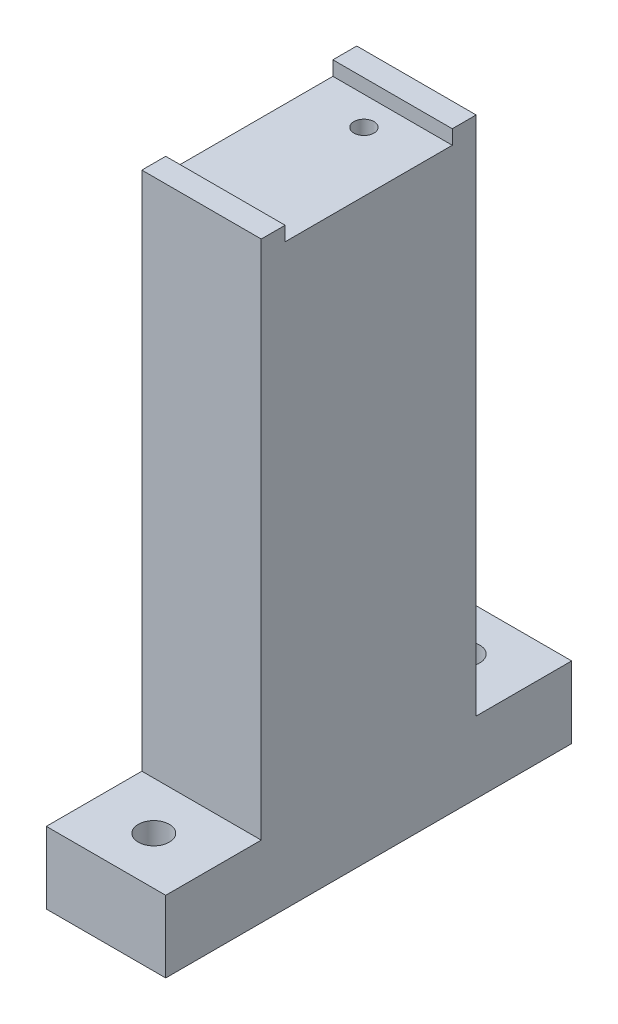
from build123d import *

# Parameters (mm, degrees)
SKETCH_1_W          = 25
SKETCH_1_H          = 124
EXTRUDE_1_DEPTH     = 85
SKETCH_2_OUTSIDE_W  = 117.48
SKETCH_2_OUTSIDE_H  = 156.48
CUT_EXTRUDE_1_DEPTH = 85
SKETCH_3_R          = 3.25
CUT_EXTRUDE_2_DEPTH = 150.969996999
SKETCH_4_R          = 2.1
CUT_EXTRUDE_3_DEPTH = 15


with BuildPart() as part:
    # Sketch 1 → Extrude 1 (new body)
    with BuildSketch(Plane.XY):
        with Locations((12.5, 62)):
            Rectangle(SKETCH_1_W, SKETCH_1_H)
    extrude(amount=EXTRUDE_1_DEPTH)

    # Sketch 2 outside → Cut-Extrude 1 (cut)
    with BuildSketch(Plane(origin=(25, 0, 0), x_dir=(0, 0, -1), z_dir=(1, 0, 0))):
        with Locations((-42.5, 62)):
            Rectangle(SKETCH_2_OUTSIDE_W, SKETCH_2_OUTSIDE_H)
        Polygon((-60, 121), (-25, 121), (-25, 124), (-20, 124), (-20, 15), (0, 15), (0, 0), (-85, 0), (-85, 15), (-65, 15), (-65, 124), (-60, 124), align=None, mode=Mode.SUBTRACT)
    extrude(amount=-CUT_EXTRUDE_1_DEPTH, mode=Mode.SUBTRACT)

    # Sketch 3 → Cut-Extrude 2 (cut, through all)
    with BuildSketch(Plane(origin=(0, 121, 0), x_dir=(1, 0, 0), z_dir=(0, 1, 0))):
        with Locations(Location((12.5, -10, 0), (0, 0, 270))):
            Circle(SKETCH_3_R)
        with Locations(Location((12.5, -75, 0), (0, 0, 270))):
            Circle(SKETCH_3_R)
    extrude(amount=-CUT_EXTRUDE_2_DEPTH, mode=Mode.SUBTRACT)

    # Sketch 4 → Cut-Extrude 3 (cut)
    with BuildSketch(Plane(origin=(0, 121, 0), x_dir=(1, 0, 0), z_dir=(0, 1, 0))):
        with Locations(Location((12.5, -31, 0), (0, 0, 270))):
            Circle(SKETCH_4_R)
    extrude(amount=-CUT_EXTRUDE_3_DEPTH, mode=Mode.SUBTRACT)


solid = part.part
